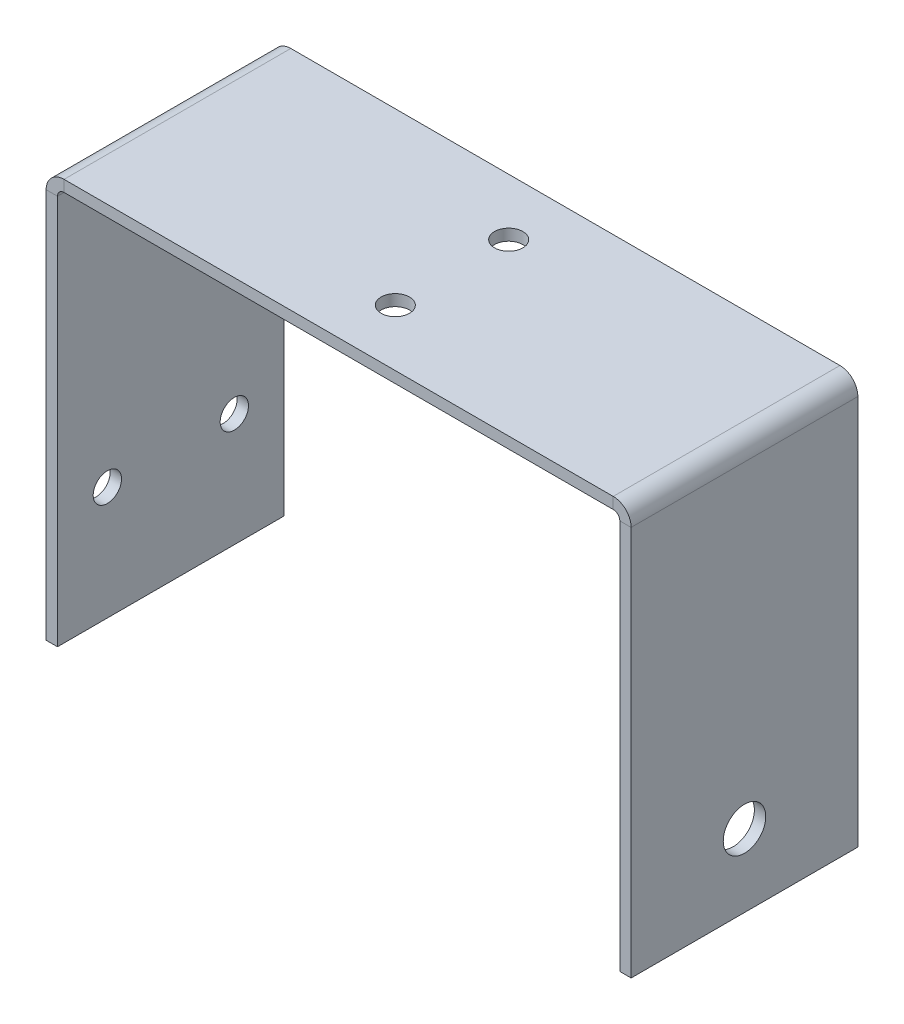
ISO-10303-21;
HEADER;
FILE_DESCRIPTION(('STEP AP214'),'2;1');
FILE_NAME('part.step','',(''),(''),'','','');
FILE_SCHEMA(('AUTOMOTIVE_DESIGN { 1 0 10303 214 1 1 1 1 }'));
ENDSEC;
DATA;
#1=APPLICATION_CONTEXT('core data for automotive mechanical design processes');
#2=APPLICATION_PROTOCOL_DEFINITION('international standard','automotive_design',2000,#1);
#3=PRODUCT_CONTEXT('',#1,'mechanical');
#4=PRODUCT('Part','Part','',(#3));
#5=PRODUCT_RELATED_PRODUCT_CATEGORY('part','',(#4));
#6=PRODUCT_DEFINITION_FORMATION('','',#4);
#7=PRODUCT_DEFINITION_CONTEXT('part definition',#1,'design');
#8=PRODUCT_DEFINITION('design','',#6,#7);
#9=PRODUCT_DEFINITION_SHAPE('','',#8);
#10=(LENGTH_UNIT() NAMED_UNIT(*) SI_UNIT(.MILLI.,.METRE.));
#11=(NAMED_UNIT(*) PLANE_ANGLE_UNIT() SI_UNIT($,.RADIAN.));
#12=(NAMED_UNIT(*) SI_UNIT($,.STERADIAN.) SOLID_ANGLE_UNIT());
#13=UNCERTAINTY_MEASURE_WITH_UNIT(LENGTH_MEASURE(1.E-05),#10,'distance_accuracy_value','');
#14=(GEOMETRIC_REPRESENTATION_CONTEXT(3) GLOBAL_UNCERTAINTY_ASSIGNED_CONTEXT((#13)) GLOBAL_UNIT_ASSIGNED_CONTEXT((#10,
#11,#12)) REPRESENTATION_CONTEXT('',''));
#15=CARTESIAN_POINT('',(0.,0.,0.));
#16=DIRECTION('',(0.,0.,1.));
#17=DIRECTION('',(1.,0.,0.));
#18=AXIS2_PLACEMENT_3D('',#15,#16,#17);
#19=CARTESIAN_POINT('',(0.,-1.27,0.));
#20=DIRECTION('',(0.,-1.,0.));
#21=DIRECTION('',(0.,0.,-1.));
#22=AXIS2_PLACEMENT_3D('',#19,#20,#21);
#23=PLANE('',#22);
#24=CARTESIAN_POINT('',(0.,-1.27,6.35));
#25=DIRECTION('',(0.,1.,0.));
#26=DIRECTION('',(0.,0.,1.));
#27=AXIS2_PLACEMENT_3D('',#24,#25,#26);
#28=CIRCLE('',#27,1.5875);
#29=CARTESIAN_POINT('',(0.,-1.27,7.9375));
#30=VERTEX_POINT('',#29);
#31=EDGE_CURVE('E240',#30,#30,#28,.T.);
#32=ORIENTED_EDGE('',*,*,#31,.T.);
#33=EDGE_LOOP('',(#32));
#34=FACE_BOUND('',#33,.T.);
#35=CARTESIAN_POINT('',(0.,-1.27,-6.35));
#36=DIRECTION('',(0.,1.,0.));
#37=DIRECTION('',(0.,0.,1.));
#38=AXIS2_PLACEMENT_3D('',#35,#36,#37);
#39=CIRCLE('',#38,1.5875);
#40=CARTESIAN_POINT('',(0.,-1.27,-4.7625));
#41=VERTEX_POINT('',#40);
#42=EDGE_CURVE('E246',#41,#41,#39,.T.);
#43=ORIENTED_EDGE('',*,*,#42,.T.);
#44=EDGE_LOOP('',(#43));
#45=FACE_BOUND('',#44,.T.);
#46=DIRECTION('',(-1.,0.,0.));
#47=VECTOR('',#46,1.);
#48=CARTESIAN_POINT('',(-31.496,-1.27,-12.7));
#49=LINE('',#48,#47);
#50=CARTESIAN_POINT('',(30.7594,-1.27,-12.7));
#51=VERTEX_POINT('',#50);
#52=CARTESIAN_POINT('',(-30.7594,-1.27,-12.7));
#53=VERTEX_POINT('',#52);
#54=EDGE_CURVE('E44',#51,#53,#49,.T.);
#55=ORIENTED_EDGE('',*,*,#54,.F.);
#56=DIRECTION('',(0.,0.,1.));
#57=VECTOR('',#56,1.);
#58=CARTESIAN_POINT('',(30.7594,-1.27,12.7));
#59=LINE('',#58,#57);
#60=CARTESIAN_POINT('',(30.7594,-1.27,12.7));
#61=VERTEX_POINT('',#60);
#62=EDGE_CURVE('E177',#61,#51,#59,.F.);
#63=ORIENTED_EDGE('',*,*,#62,.F.);
#64=DIRECTION('',(1.,0.,0.));
#65=VECTOR('',#64,1.);
#66=CARTESIAN_POINT('',(-31.496,-1.27,12.7));
#67=LINE('',#66,#65);
#68=CARTESIAN_POINT('',(-30.7594,-1.27,12.7));
#69=VERTEX_POINT('',#68);
#70=EDGE_CURVE('E11',#69,#61,#67,.T.);
#71=ORIENTED_EDGE('',*,*,#70,.F.);
#72=DIRECTION('',(0.,0.,-1.));
#73=VECTOR('',#72,1.);
#74=CARTESIAN_POINT('',(-30.7594,-1.27,-12.7));
#75=LINE('',#74,#73);
#76=EDGE_CURVE('E232',#53,#69,#75,.F.);
#77=ORIENTED_EDGE('',*,*,#76,.F.);
#78=EDGE_LOOP('',(#55,#63,#71,#77));
#79=FACE_BOUND('',#78,.T.);
#80=ADVANCED_FACE('F35',(#34,#45,#79),#23,.T.);
#81=CARTESIAN_POINT('',(0.,0.,0.));
#82=DIRECTION('',(0.,-1.,0.));
#83=DIRECTION('',(0.,0.,-1.));
#84=AXIS2_PLACEMENT_3D('',#81,#82,#83);
#85=PLANE('',#84);
#86=CARTESIAN_POINT('',(0.,0.,6.35));
#87=DIRECTION('',(0.,1.,0.));
#88=DIRECTION('',(0.,0.,1.));
#89=AXIS2_PLACEMENT_3D('',#86,#87,#88);
#90=CIRCLE('',#89,1.5875);
#91=CARTESIAN_POINT('',(0.,0.,7.9375));
#92=VERTEX_POINT('',#91);
#93=EDGE_CURVE('E238',#92,#92,#90,.T.);
#94=ORIENTED_EDGE('',*,*,#93,.F.);
#95=EDGE_LOOP('',(#94));
#96=FACE_BOUND('',#95,.T.);
#97=CARTESIAN_POINT('',(0.,0.,-6.35));
#98=DIRECTION('',(0.,1.,0.));
#99=DIRECTION('',(0.,0.,1.));
#100=AXIS2_PLACEMENT_3D('',#97,#98,#99);
#101=CIRCLE('',#100,1.5875);
#102=CARTESIAN_POINT('',(0.,0.,-4.7625));
#103=VERTEX_POINT('',#102);
#104=EDGE_CURVE('E243',#103,#103,#101,.T.);
#105=ORIENTED_EDGE('',*,*,#104,.F.);
#106=EDGE_LOOP('',(#105));
#107=FACE_BOUND('',#106,.T.);
#108=DIRECTION('',(0.,0.,1.));
#109=VECTOR('',#108,1.);
#110=CARTESIAN_POINT('',(30.7594,0.,12.7));
#111=LINE('',#110,#109);
#112=CARTESIAN_POINT('',(30.7594,0.,12.7));
#113=VERTEX_POINT('',#112);
#114=CARTESIAN_POINT('',(30.7594,0.,-12.7));
#115=VERTEX_POINT('',#114);
#116=EDGE_CURVE('E165',#113,#115,#111,.F.);
#117=ORIENTED_EDGE('',*,*,#116,.T.);
#118=DIRECTION('',(-1.,0.,0.));
#119=VECTOR('',#118,1.);
#120=CARTESIAN_POINT('',(-31.496,0.,-12.7));
#121=LINE('',#120,#119);
#122=CARTESIAN_POINT('',(-30.7594,0.,-12.7));
#123=VERTEX_POINT('',#122);
#124=EDGE_CURVE('E249',#115,#123,#121,.T.);
#125=ORIENTED_EDGE('',*,*,#124,.T.);
#126=DIRECTION('',(0.,0.,-1.));
#127=VECTOR('',#126,1.);
#128=CARTESIAN_POINT('',(-30.7594,0.,-12.7));
#129=LINE('',#128,#127);
#130=CARTESIAN_POINT('',(-30.7594,0.,12.7));
#131=VERTEX_POINT('',#130);
#132=EDGE_CURVE('E220',#123,#131,#129,.F.);
#133=ORIENTED_EDGE('',*,*,#132,.T.);
#134=DIRECTION('',(1.,0.,0.));
#135=VECTOR('',#134,1.);
#136=CARTESIAN_POINT('',(-31.496,0.,12.7));
#137=LINE('',#136,#135);
#138=EDGE_CURVE('E252',#131,#113,#137,.T.);
#139=ORIENTED_EDGE('',*,*,#138,.T.);
#140=EDGE_LOOP('',(#117,#125,#133,#139));
#141=FACE_BOUND('',#140,.T.);
#142=ADVANCED_FACE('F299',(#96,#107,#141),#85,.F.);
#143=CARTESIAN_POINT('',(-31.496,-1.27,12.7));
#144=DIRECTION('',(0.,0.,1.));
#145=DIRECTION('',(1.,0.,0.));
#146=AXIS2_PLACEMENT_3D('',#143,#144,#145);
#147=PLANE('',#146);
#148=ORIENTED_EDGE('',*,*,#70,.T.);
#149=DIRECTION('',(0.,1.,0.));
#150=VECTOR('',#149,1.);
#151=CARTESIAN_POINT('',(30.7594,-1.27,12.7));
#152=LINE('',#151,#150);
#153=EDGE_CURVE('E171',#61,#113,#152,.T.);
#154=ORIENTED_EDGE('',*,*,#153,.T.);
#155=ORIENTED_EDGE('',*,*,#138,.F.);
#156=DIRECTION('',(0.,1.,0.));
#157=VECTOR('',#156,1.);
#158=CARTESIAN_POINT('',(-30.7594,-1.27,12.7));
#159=LINE('',#158,#157);
#160=EDGE_CURVE('E58',#69,#131,#159,.T.);
#161=ORIENTED_EDGE('',*,*,#160,.F.);
#162=EDGE_LOOP('',(#148,#154,#155,#161));
#163=FACE_BOUND('',#162,.T.);
#164=ADVANCED_FACE('F295',(#163),#147,.T.);
#165=CARTESIAN_POINT('',(-31.496,-1.27,-12.7));
#166=DIRECTION('',(0.,0.,-1.));
#167=DIRECTION('',(-1.,0.,0.));
#168=AXIS2_PLACEMENT_3D('',#165,#166,#167);
#169=PLANE('',#168);
#170=DIRECTION('',(0.,1.,0.));
#171=VECTOR('',#170,1.);
#172=CARTESIAN_POINT('',(30.7594,-1.27,-12.7));
#173=LINE('',#172,#171);
#174=EDGE_CURVE('E182',#51,#115,#173,.T.);
#175=ORIENTED_EDGE('',*,*,#174,.F.);
#176=ORIENTED_EDGE('',*,*,#54,.T.);
#177=DIRECTION('',(0.,1.,0.));
#178=VECTOR('',#177,1.);
#179=CARTESIAN_POINT('',(-30.7594,-1.27,-12.7));
#180=LINE('',#179,#178);
#181=EDGE_CURVE('E226',#53,#123,#180,.T.);
#182=ORIENTED_EDGE('',*,*,#181,.T.);
#183=ORIENTED_EDGE('',*,*,#124,.F.);
#184=EDGE_LOOP('',(#175,#176,#182,#183));
#185=FACE_BOUND('',#184,.T.);
#186=ADVANCED_FACE('F37',(#185),#169,.T.);
#187=CARTESIAN_POINT('',(0.,-1.27,-6.35));
#188=DIRECTION('',(0.,1.,0.));
#189=DIRECTION('',(0.,0.,1.));
#190=AXIS2_PLACEMENT_3D('',#187,#188,#189);
#191=CYLINDRICAL_SURFACE('',#190,1.5875);
#192=ORIENTED_EDGE('',*,*,#42,.F.);
#193=EDGE_LOOP('',(#192));
#194=FACE_BOUND('',#193,.T.);
#195=ORIENTED_EDGE('',*,*,#104,.T.);
#196=EDGE_LOOP('',(#195));
#197=FACE_BOUND('',#196,.T.);
#198=ADVANCED_FACE('F326',(#194,#197),#191,.F.);
#199=CARTESIAN_POINT('',(0.,-1.27,6.35));
#200=DIRECTION('',(0.,1.,0.));
#201=DIRECTION('',(0.,0.,1.));
#202=AXIS2_PLACEMENT_3D('',#199,#200,#201);
#203=CYLINDRICAL_SURFACE('',#202,1.5875);
#204=ORIENTED_EDGE('',*,*,#31,.F.);
#205=EDGE_LOOP('',(#204));
#206=FACE_BOUND('',#205,.T.);
#207=ORIENTED_EDGE('',*,*,#93,.T.);
#208=EDGE_LOOP('',(#207));
#209=FACE_BOUND('',#208,.T.);
#210=ADVANCED_FACE('F335',(#206,#209),#203,.F.);
#211=CARTESIAN_POINT('',(-30.7594,-2.0066,12.7));
#212=DIRECTION('',(0.,0.,1.));
#213=DIRECTION('',(1.,0.,0.));
#214=AXIS2_PLACEMENT_3D('',#211,#212,#213);
#215=PLANE('',#214);
#216=DIRECTION('',(-1.,0.,0.));
#217=VECTOR('',#216,1.);
#218=CARTESIAN_POINT('',(-31.496,-2.0066,12.7));
#219=LINE('',#218,#217);
#220=CARTESIAN_POINT('',(-31.496,-2.0066,12.7));
#221=VERTEX_POINT('',#220);
#222=CARTESIAN_POINT('',(-32.766,-2.0066,12.7));
#223=VERTEX_POINT('',#222);
#224=EDGE_CURVE('E185',#221,#223,#219,.T.);
#225=ORIENTED_EDGE('',*,*,#224,.F.);
#226=CARTESIAN_POINT('',(-30.7594,-2.0066,12.7));
#227=DIRECTION('',(0.,0.,-1.));
#228=DIRECTION('',(-1.,0.,0.));
#229=AXIS2_PLACEMENT_3D('',#226,#227,#228);
#230=CIRCLE('',#229,0.7366);
#231=EDGE_CURVE('E229',#69,#221,#230,.F.);
#232=ORIENTED_EDGE('',*,*,#231,.F.);
#233=ORIENTED_EDGE('',*,*,#160,.T.);
#234=CARTESIAN_POINT('',(-30.7594,-2.0066,12.7));
#235=DIRECTION('',(0.,0.,-1.));
#236=DIRECTION('',(-1.,0.,0.));
#237=AXIS2_PLACEMENT_3D('',#234,#235,#236);
#238=CIRCLE('',#237,2.0066);
#239=EDGE_CURVE('E222',#131,#223,#238,.F.);
#240=ORIENTED_EDGE('',*,*,#239,.T.);
#241=EDGE_LOOP('',(#225,#232,#233,#240));
#242=FACE_BOUND('',#241,.T.);
#243=ADVANCED_FACE('F340',(#242),#215,.T.);
#244=CARTESIAN_POINT('',(-30.7594,-2.0066,-12.7));
#245=DIRECTION('',(0.,0.,1.));
#246=DIRECTION('',(1.,0.,0.));
#247=AXIS2_PLACEMENT_3D('',#244,#245,#246);
#248=PLANE('',#247);
#249=CARTESIAN_POINT('',(-30.7594,-2.0066,-12.7));
#250=DIRECTION('',(0.,0.,-1.));
#251=DIRECTION('',(-1.,0.,0.));
#252=AXIS2_PLACEMENT_3D('',#249,#250,#251);
#253=CIRCLE('',#252,0.7366);
#254=CARTESIAN_POINT('',(-31.496,-2.0066,-12.7));
#255=VERTEX_POINT('',#254);
#256=EDGE_CURVE('E217',#255,#53,#253,.T.);
#257=ORIENTED_EDGE('',*,*,#256,.F.);
#258=DIRECTION('',(-1.,0.,0.));
#259=VECTOR('',#258,1.);
#260=CARTESIAN_POINT('',(-31.496,-2.0066,-12.7));
#261=LINE('',#260,#259);
#262=CARTESIAN_POINT('',(-32.766,-2.0066,-12.7));
#263=VERTEX_POINT('',#262);
#264=EDGE_CURVE('E190',#255,#263,#261,.T.);
#265=ORIENTED_EDGE('',*,*,#264,.T.);
#266=CARTESIAN_POINT('',(-30.7594,-2.0066,-12.7));
#267=DIRECTION('',(0.,0.,-1.));
#268=DIRECTION('',(-1.,0.,0.));
#269=AXIS2_PLACEMENT_3D('',#266,#267,#268);
#270=CIRCLE('',#269,2.0066);
#271=EDGE_CURVE('E223',#263,#123,#270,.T.);
#272=ORIENTED_EDGE('',*,*,#271,.T.);
#273=ORIENTED_EDGE('',*,*,#181,.F.);
#274=EDGE_LOOP('',(#257,#265,#272,#273));
#275=FACE_BOUND('',#274,.T.);
#276=ADVANCED_FACE('F351',(#275),#248,.F.);
#277=CARTESIAN_POINT('',(-30.7594,-2.0066,-12.7));
#278=DIRECTION('',(0.,0.,-1.));
#279=DIRECTION('',(-1.,0.,0.));
#280=AXIS2_PLACEMENT_3D('',#277,#278,#279);
#281=CYLINDRICAL_SURFACE('',#280,2.0066);
#282=ORIENTED_EDGE('',*,*,#132,.F.);
#283=ORIENTED_EDGE('',*,*,#271,.F.);
#284=DIRECTION('',(0.,0.,-1.));
#285=VECTOR('',#284,1.);
#286=CARTESIAN_POINT('',(-32.766,-2.0066,0.));
#287=LINE('',#286,#285);
#288=EDGE_CURVE('E193',#223,#263,#287,.T.);
#289=ORIENTED_EDGE('',*,*,#288,.F.);
#290=ORIENTED_EDGE('',*,*,#239,.F.);
#291=EDGE_LOOP('',(#282,#283,#289,#290));
#292=FACE_BOUND('',#291,.T.);
#293=ADVANCED_FACE('F371',(#292),#281,.T.);
#294=CARTESIAN_POINT('',(-30.7594,-2.0066,-12.7));
#295=DIRECTION('',(0.,0.,-1.));
#296=DIRECTION('',(-1.,0.,0.));
#297=AXIS2_PLACEMENT_3D('',#294,#295,#296);
#298=CYLINDRICAL_SURFACE('',#297,0.7366);
#299=ORIENTED_EDGE('',*,*,#76,.T.);
#300=ORIENTED_EDGE('',*,*,#231,.T.);
#301=DIRECTION('',(0.,0.,-1.));
#302=VECTOR('',#301,1.);
#303=CARTESIAN_POINT('',(-31.496,-2.0066,12.7));
#304=LINE('',#303,#302);
#305=EDGE_CURVE('E188',#221,#255,#304,.T.);
#306=ORIENTED_EDGE('',*,*,#305,.T.);
#307=ORIENTED_EDGE('',*,*,#256,.T.);
#308=EDGE_LOOP('',(#299,#300,#306,#307));
#309=FACE_BOUND('',#308,.T.);
#310=ADVANCED_FACE('F352',(#309),#298,.F.);
#311=CARTESIAN_POINT('',(-32.766,-1.27,-12.7));
#312=DIRECTION('',(0.,0.,-1.));
#313=DIRECTION('',(0.,1.,0.));
#314=AXIS2_PLACEMENT_3D('',#311,#312,#313);
#315=PLANE('',#314);
#316=DIRECTION('',(0.,1.,0.));
#317=VECTOR('',#316,1.);
#318=CARTESIAN_POINT('',(-32.766,-1.27,-12.7));
#319=LINE('',#318,#317);
#320=CARTESIAN_POINT('',(-32.7660000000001,-45.72,-12.7));
#321=VERTEX_POINT('',#320);
#322=EDGE_CURVE('E205',#321,#263,#319,.T.);
#323=ORIENTED_EDGE('',*,*,#322,.T.);
#324=ORIENTED_EDGE('',*,*,#264,.F.);
#325=DIRECTION('',(0.,1.,0.));
#326=VECTOR('',#325,1.);
#327=CARTESIAN_POINT('',(-31.496,-1.27,-12.7));
#328=LINE('',#327,#326);
#329=CARTESIAN_POINT('',(-31.4960000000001,-45.72,-12.7));
#330=VERTEX_POINT('',#329);
#331=EDGE_CURVE('E202',#330,#255,#328,.T.);
#332=ORIENTED_EDGE('',*,*,#331,.F.);
#333=DIRECTION('',(1.,0.,0.));
#334=VECTOR('',#333,1.);
#335=CARTESIAN_POINT('',(-32.7660000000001,-45.72,-12.7));
#336=LINE('',#335,#334);
#337=EDGE_CURVE('E215',#321,#330,#336,.T.);
#338=ORIENTED_EDGE('',*,*,#337,.F.);
#339=EDGE_LOOP('',(#323,#324,#332,#338));
#340=FACE_BOUND('',#339,.T.);
#341=ADVANCED_FACE('F365',(#340),#315,.T.);
#342=CARTESIAN_POINT('',(-32.7660000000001,-45.72,12.7));
#343=DIRECTION('',(0.,0.,1.));
#344=DIRECTION('',(0.,-1.,0.));
#345=AXIS2_PLACEMENT_3D('',#342,#343,#344);
#346=PLANE('',#345);
#347=DIRECTION('',(0.,-1.,0.));
#348=VECTOR('',#347,1.);
#349=CARTESIAN_POINT('',(-31.4960000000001,-45.72,12.7));
#350=LINE('',#349,#348);
#351=CARTESIAN_POINT('',(-31.4960000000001,-45.72,12.7));
#352=VERTEX_POINT('',#351);
#353=EDGE_CURVE('E198',#221,#352,#350,.T.);
#354=ORIENTED_EDGE('',*,*,#353,.F.);
#355=ORIENTED_EDGE('',*,*,#224,.T.);
#356=DIRECTION('',(0.,-1.,0.));
#357=VECTOR('',#356,1.);
#358=CARTESIAN_POINT('',(-32.7660000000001,-45.72,12.7));
#359=LINE('',#358,#357);
#360=CARTESIAN_POINT('',(-32.7660000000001,-45.72,12.7));
#361=VERTEX_POINT('',#360);
#362=EDGE_CURVE('E199',#223,#361,#359,.T.);
#363=ORIENTED_EDGE('',*,*,#362,.T.);
#364=DIRECTION('',(1.,0.,0.));
#365=VECTOR('',#364,1.);
#366=CARTESIAN_POINT('',(-32.7660000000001,-45.72,12.7));
#367=LINE('',#366,#365);
#368=EDGE_CURVE('E208',#361,#352,#367,.T.);
#369=ORIENTED_EDGE('',*,*,#368,.T.);
#370=EDGE_LOOP('',(#354,#355,#363,#369));
#371=FACE_BOUND('',#370,.T.);
#372=ADVANCED_FACE('F359',(#371),#346,.T.);
#373=CARTESIAN_POINT('',(-32.766,1.12601624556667E-13,0.));
#374=DIRECTION('',(-1.,0.,0.));
#375=DIRECTION('',(0.,-1.,0.));
#376=AXIS2_PLACEMENT_3D('',#373,#374,#375);
#377=PLANE('',#376);
#378=CARTESIAN_POINT('',(-32.7660000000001,-33.02,-7.112));
#379=DIRECTION('',(-1.,0.,0.));
#380=DIRECTION('',(0.,1.,0.));
#381=AXIS2_PLACEMENT_3D('',#378,#379,#380);
#382=CIRCLE('',#381,1.5875);
#383=CARTESIAN_POINT('',(-32.7660000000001,-31.4325,-7.112));
#384=VERTEX_POINT('',#383);
#385=EDGE_CURVE('E261',#384,#384,#382,.T.);
#386=ORIENTED_EDGE('',*,*,#385,.F.);
#387=EDGE_LOOP('',(#386));
#388=FACE_BOUND('',#387,.T.);
#389=CARTESIAN_POINT('',(-32.7660000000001,-33.02,7.11199999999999));
#390=DIRECTION('',(-1.,0.,0.));
#391=DIRECTION('',(0.,-1.,0.));
#392=AXIS2_PLACEMENT_3D('',#389,#390,#391);
#393=CIRCLE('',#392,1.5875);
#394=CARTESIAN_POINT('',(-32.7660000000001,-34.6075,7.11199999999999));
#395=VERTEX_POINT('',#394);
#396=EDGE_CURVE('E258',#395,#395,#393,.T.);
#397=ORIENTED_EDGE('',*,*,#396,.F.);
#398=EDGE_LOOP('',(#397));
#399=FACE_BOUND('',#398,.T.);
#400=ORIENTED_EDGE('',*,*,#362,.F.);
#401=ORIENTED_EDGE('',*,*,#288,.T.);
#402=ORIENTED_EDGE('',*,*,#322,.F.);
#403=DIRECTION('',(0.,0.,-1.));
#404=VECTOR('',#403,1.);
#405=CARTESIAN_POINT('',(-32.7660000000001,-45.72,-12.7));
#406=LINE('',#405,#404);
#407=EDGE_CURVE('E201',#361,#321,#406,.T.);
#408=ORIENTED_EDGE('',*,*,#407,.F.);
#409=EDGE_LOOP('',(#400,#401,#402,#408));
#410=FACE_BOUND('',#409,.T.);
#411=ADVANCED_FACE('F368',(#388,#399,#410),#377,.T.);
#412=CARTESIAN_POINT('',(-31.496,1.08167443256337E-13,0.));
#413=DIRECTION('',(-1.,0.,0.));
#414=DIRECTION('',(0.,-1.,0.));
#415=AXIS2_PLACEMENT_3D('',#412,#413,#414);
#416=PLANE('',#415);
#417=CARTESIAN_POINT('',(-31.4960000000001,-33.02,-7.112));
#418=DIRECTION('',(-1.,0.,0.));
#419=DIRECTION('',(0.,-1.,0.));
#420=AXIS2_PLACEMENT_3D('',#417,#418,#419);
#421=CIRCLE('',#420,1.5875);
#422=CARTESIAN_POINT('',(-31.4960000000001,-34.6075,-7.112));
#423=VERTEX_POINT('',#422);
#424=EDGE_CURVE('E259',#423,#423,#421,.T.);
#425=ORIENTED_EDGE('',*,*,#424,.T.);
#426=EDGE_LOOP('',(#425));
#427=FACE_BOUND('',#426,.T.);
#428=CARTESIAN_POINT('',(-31.4960000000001,-33.02,7.11199999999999));
#429=DIRECTION('',(-1.,0.,0.));
#430=DIRECTION('',(0.,-1.,0.));
#431=AXIS2_PLACEMENT_3D('',#428,#429,#430);
#432=CIRCLE('',#431,1.5875);
#433=CARTESIAN_POINT('',(-31.4960000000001,-34.6075,7.11199999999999));
#434=VERTEX_POINT('',#433);
#435=EDGE_CURVE('E256',#434,#434,#432,.T.);
#436=ORIENTED_EDGE('',*,*,#435,.T.);
#437=EDGE_LOOP('',(#436));
#438=FACE_BOUND('',#437,.T.);
#439=ORIENTED_EDGE('',*,*,#305,.F.);
#440=ORIENTED_EDGE('',*,*,#353,.T.);
#441=DIRECTION('',(0.,0.,-1.));
#442=VECTOR('',#441,1.);
#443=CARTESIAN_POINT('',(-31.4960000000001,-45.72,-12.7));
#444=LINE('',#443,#442);
#445=EDGE_CURVE('E210',#352,#330,#444,.T.);
#446=ORIENTED_EDGE('',*,*,#445,.T.);
#447=ORIENTED_EDGE('',*,*,#331,.T.);
#448=EDGE_LOOP('',(#439,#440,#446,#447));
#449=FACE_BOUND('',#448,.T.);
#450=ADVANCED_FACE('F312',(#427,#438,#449),#416,.F.);
#451=CARTESIAN_POINT('',(-32.7660000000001,-45.72,-12.7));
#452=DIRECTION('',(0.,-1.,0.));
#453=DIRECTION('',(1.,0.,0.));
#454=AXIS2_PLACEMENT_3D('',#451,#452,#453);
#455=PLANE('',#454);
#456=ORIENTED_EDGE('',*,*,#445,.F.);
#457=ORIENTED_EDGE('',*,*,#368,.F.);
#458=ORIENTED_EDGE('',*,*,#407,.T.);
#459=ORIENTED_EDGE('',*,*,#337,.T.);
#460=EDGE_LOOP('',(#456,#457,#458,#459));
#461=FACE_BOUND('',#460,.T.);
#462=ADVANCED_FACE('F305',(#461),#455,.T.);
#463=CARTESIAN_POINT('',(30.7594,-2.0066,-12.7));
#464=DIRECTION('',(0.,0.,-1.));
#465=DIRECTION('',(-1.,0.,0.));
#466=AXIS2_PLACEMENT_3D('',#463,#464,#465);
#467=PLANE('',#466);
#468=DIRECTION('',(1.,0.,0.));
#469=VECTOR('',#468,1.);
#470=CARTESIAN_POINT('',(31.496,-2.0066,-12.7));
#471=LINE('',#470,#469);
#472=CARTESIAN_POINT('',(31.496,-2.0066,-12.7));
#473=VERTEX_POINT('',#472);
#474=CARTESIAN_POINT('',(32.766,-2.0066,-12.7));
#475=VERTEX_POINT('',#474);
#476=EDGE_CURVE('E151',#473,#475,#471,.T.);
#477=ORIENTED_EDGE('',*,*,#476,.F.);
#478=CARTESIAN_POINT('',(30.7594,-2.0066,-12.7));
#479=DIRECTION('',(0.,0.,1.));
#480=DIRECTION('',(1.,0.,0.));
#481=AXIS2_PLACEMENT_3D('',#478,#479,#480);
#482=CIRCLE('',#481,0.7366);
#483=EDGE_CURVE('E174',#51,#473,#482,.F.);
#484=ORIENTED_EDGE('',*,*,#483,.F.);
#485=ORIENTED_EDGE('',*,*,#174,.T.);
#486=CARTESIAN_POINT('',(30.7594,-2.0066,-12.7));
#487=DIRECTION('',(0.,0.,1.));
#488=DIRECTION('',(1.,0.,0.));
#489=AXIS2_PLACEMENT_3D('',#486,#487,#488);
#490=CIRCLE('',#489,2.0066);
#491=EDGE_CURVE('E167',#115,#475,#490,.F.);
#492=ORIENTED_EDGE('',*,*,#491,.T.);
#493=EDGE_LOOP('',(#477,#484,#485,#492));
#494=FACE_BOUND('',#493,.T.);
#495=ADVANCED_FACE('F303',(#494),#467,.T.);
#496=CARTESIAN_POINT('',(30.7594,-2.0066,12.7));
#497=DIRECTION('',(0.,0.,-1.));
#498=DIRECTION('',(-1.,0.,0.));
#499=AXIS2_PLACEMENT_3D('',#496,#497,#498);
#500=PLANE('',#499);
#501=CARTESIAN_POINT('',(30.7594,-2.0066,12.7));
#502=DIRECTION('',(0.,0.,1.));
#503=DIRECTION('',(1.,0.,0.));
#504=AXIS2_PLACEMENT_3D('',#501,#502,#503);
#505=CIRCLE('',#504,0.7366);
#506=CARTESIAN_POINT('',(31.496,-2.0066,12.7));
#507=VERTEX_POINT('',#506);
#508=EDGE_CURVE('E163',#507,#61,#505,.T.);
#509=ORIENTED_EDGE('',*,*,#508,.F.);
#510=DIRECTION('',(1.,0.,0.));
#511=VECTOR('',#510,1.);
#512=CARTESIAN_POINT('',(31.496,-2.0066,12.7));
#513=LINE('',#512,#511);
#514=CARTESIAN_POINT('',(32.766,-2.0066,12.7));
#515=VERTEX_POINT('',#514);
#516=EDGE_CURVE('E276',#507,#515,#513,.T.);
#517=ORIENTED_EDGE('',*,*,#516,.T.);
#518=CARTESIAN_POINT('',(30.7594,-2.0066,12.7));
#519=DIRECTION('',(0.,0.,1.));
#520=DIRECTION('',(1.,0.,0.));
#521=AXIS2_PLACEMENT_3D('',#518,#519,#520);
#522=CIRCLE('',#521,2.0066);
#523=EDGE_CURVE('E168',#515,#113,#522,.T.);
#524=ORIENTED_EDGE('',*,*,#523,.T.);
#525=ORIENTED_EDGE('',*,*,#153,.F.);
#526=EDGE_LOOP('',(#509,#517,#524,#525));
#527=FACE_BOUND('',#526,.T.);
#528=ADVANCED_FACE('F293',(#527),#500,.F.);
#529=CARTESIAN_POINT('',(30.7594,-2.0066,12.7));
#530=DIRECTION('',(0.,0.,1.));
#531=DIRECTION('',(1.,0.,0.));
#532=AXIS2_PLACEMENT_3D('',#529,#530,#531);
#533=CYLINDRICAL_SURFACE('',#532,2.0066);
#534=ORIENTED_EDGE('',*,*,#116,.F.);
#535=ORIENTED_EDGE('',*,*,#523,.F.);
#536=DIRECTION('',(0.,0.,1.));
#537=VECTOR('',#536,1.);
#538=CARTESIAN_POINT('',(32.766,-2.0066,0.));
#539=LINE('',#538,#537);
#540=EDGE_CURVE('E156',#475,#515,#539,.T.);
#541=ORIENTED_EDGE('',*,*,#540,.F.);
#542=ORIENTED_EDGE('',*,*,#491,.F.);
#543=EDGE_LOOP('',(#534,#535,#541,#542));
#544=FACE_BOUND('',#543,.T.);
#545=ADVANCED_FACE('F296',(#544),#533,.T.);
#546=CARTESIAN_POINT('',(30.7594,-2.0066,12.7));
#547=DIRECTION('',(0.,0.,1.));
#548=DIRECTION('',(1.,0.,0.));
#549=AXIS2_PLACEMENT_3D('',#546,#547,#548);
#550=CYLINDRICAL_SURFACE('',#549,0.7366);
#551=ORIENTED_EDGE('',*,*,#62,.T.);
#552=ORIENTED_EDGE('',*,*,#483,.T.);
#553=DIRECTION('',(0.,0.,1.));
#554=VECTOR('',#553,1.);
#555=CARTESIAN_POINT('',(31.496,-2.0066,-12.7));
#556=LINE('',#555,#554);
#557=EDGE_CURVE('E274',#473,#507,#556,.T.);
#558=ORIENTED_EDGE('',*,*,#557,.T.);
#559=ORIENTED_EDGE('',*,*,#508,.T.);
#560=EDGE_LOOP('',(#551,#552,#558,#559));
#561=FACE_BOUND('',#560,.T.);
#562=ADVANCED_FACE('F290',(#561),#550,.F.);
#563=CARTESIAN_POINT('',(32.7660000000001,-45.72,12.7));
#564=DIRECTION('',(0.,0.,-1.));
#565=DIRECTION('',(0.,1.,0.));
#566=AXIS2_PLACEMENT_3D('',#563,#564,#565);
#567=PLANE('',#566);
#568=ORIENTED_EDGE('',*,*,#516,.F.);
#569=DIRECTION('',(0.,-1.,0.));
#570=VECTOR('',#569,1.);
#571=CARTESIAN_POINT('',(31.4960000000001,-45.72,12.7));
#572=LINE('',#571,#570);
#573=CARTESIAN_POINT('',(31.4960000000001,-45.72,12.7));
#574=VERTEX_POINT('',#573);
#575=EDGE_CURVE('E152',#507,#574,#572,.T.);
#576=ORIENTED_EDGE('',*,*,#575,.T.);
#577=DIRECTION('',(-1.,0.,0.));
#578=VECTOR('',#577,1.);
#579=CARTESIAN_POINT('',(32.7660000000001,-45.72,12.7));
#580=LINE('',#579,#578);
#581=CARTESIAN_POINT('',(32.7660000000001,-45.72,12.7));
#582=VERTEX_POINT('',#581);
#583=EDGE_CURVE('E147',#582,#574,#580,.T.);
#584=ORIENTED_EDGE('',*,*,#583,.F.);
#585=DIRECTION('',(0.,-1.,0.));
#586=VECTOR('',#585,1.);
#587=CARTESIAN_POINT('',(32.7660000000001,-45.72,12.7));
#588=LINE('',#587,#586);
#589=EDGE_CURVE('E134',#515,#582,#588,.T.);
#590=ORIENTED_EDGE('',*,*,#589,.F.);
#591=EDGE_LOOP('',(#568,#576,#584,#590));
#592=FACE_BOUND('',#591,.T.);
#593=ADVANCED_FACE('F284',(#592),#567,.F.);
#594=CARTESIAN_POINT('',(32.766,-1.27,-12.7));
#595=DIRECTION('',(0.,0.,1.));
#596=DIRECTION('',(0.,-1.,0.));
#597=AXIS2_PLACEMENT_3D('',#594,#595,#596);
#598=PLANE('',#597);
#599=ORIENTED_EDGE('',*,*,#476,.T.);
#600=DIRECTION('',(0.,1.,0.));
#601=VECTOR('',#600,1.);
#602=CARTESIAN_POINT('',(32.766,-1.27,-12.7));
#603=LINE('',#602,#601);
#604=CARTESIAN_POINT('',(32.7660000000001,-45.72,-12.7));
#605=VERTEX_POINT('',#604);
#606=EDGE_CURVE('E132',#605,#475,#603,.T.);
#607=ORIENTED_EDGE('',*,*,#606,.F.);
#608=DIRECTION('',(-1.,0.,0.));
#609=VECTOR('',#608,1.);
#610=CARTESIAN_POINT('',(32.7660000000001,-45.72,-12.7));
#611=LINE('',#610,#609);
#612=CARTESIAN_POINT('',(31.4960000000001,-45.72,-12.7));
#613=VERTEX_POINT('',#612);
#614=EDGE_CURVE('E140',#605,#613,#611,.T.);
#615=ORIENTED_EDGE('',*,*,#614,.T.);
#616=DIRECTION('',(0.,1.,0.));
#617=VECTOR('',#616,1.);
#618=CARTESIAN_POINT('',(31.496,-1.27,-12.7));
#619=LINE('',#618,#617);
#620=EDGE_CURVE('E160',#613,#473,#619,.T.);
#621=ORIENTED_EDGE('',*,*,#620,.T.);
#622=EDGE_LOOP('',(#599,#607,#615,#621));
#623=FACE_BOUND('',#622,.T.);
#624=ADVANCED_FACE('F150',(#623),#598,.F.);
#625=CARTESIAN_POINT('',(32.766,1.12601624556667E-13,0.));
#626=DIRECTION('',(1.,0.,0.));
#627=DIRECTION('',(0.,-1.,0.));
#628=AXIS2_PLACEMENT_3D('',#625,#626,#627);
#629=PLANE('',#628);
#630=CARTESIAN_POINT('',(32.7660000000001,-37.592,0.));
#631=DIRECTION('',(1.,0.,0.));
#632=DIRECTION('',(0.,1.,0.));
#633=AXIS2_PLACEMENT_3D('',#630,#631,#632);
#634=CIRCLE('',#633,2.38125);
#635=CARTESIAN_POINT('',(32.7660000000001,-35.21075,0.));
#636=VERTEX_POINT('',#635);
#637=EDGE_CURVE('E271',#636,#636,#634,.T.);
#638=ORIENTED_EDGE('',*,*,#637,.F.);
#639=EDGE_LOOP('',(#638));
#640=FACE_BOUND('',#639,.T.);
#641=ORIENTED_EDGE('',*,*,#606,.T.);
#642=ORIENTED_EDGE('',*,*,#540,.T.);
#643=ORIENTED_EDGE('',*,*,#589,.T.);
#644=DIRECTION('',(0.,0.,-1.));
#645=VECTOR('',#644,1.);
#646=CARTESIAN_POINT('',(32.7660000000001,-45.72,-12.7));
#647=LINE('',#646,#645);
#648=EDGE_CURVE('E127',#582,#605,#647,.T.);
#649=ORIENTED_EDGE('',*,*,#648,.T.);
#650=EDGE_LOOP('',(#641,#642,#643,#649));
#651=FACE_BOUND('',#650,.T.);
#652=ADVANCED_FACE('F129',(#640,#651),#629,.T.);
#653=CARTESIAN_POINT('',(31.496,1.08167443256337E-13,0.));
#654=DIRECTION('',(1.,0.,0.));
#655=DIRECTION('',(0.,-1.,0.));
#656=AXIS2_PLACEMENT_3D('',#653,#654,#655);
#657=PLANE('',#656);
#658=CARTESIAN_POINT('',(31.4960000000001,-37.592,0.));
#659=DIRECTION('',(1.,0.,0.));
#660=DIRECTION('',(0.,1.,0.));
#661=AXIS2_PLACEMENT_3D('',#658,#659,#660);
#662=CIRCLE('',#661,2.38125);
#663=CARTESIAN_POINT('',(31.4960000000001,-35.21075,0.));
#664=VERTEX_POINT('',#663);
#665=EDGE_CURVE('E39',#664,#664,#662,.T.);
#666=ORIENTED_EDGE('',*,*,#665,.T.);
#667=EDGE_LOOP('',(#666));
#668=FACE_BOUND('',#667,.T.);
#669=ORIENTED_EDGE('',*,*,#557,.F.);
#670=ORIENTED_EDGE('',*,*,#620,.F.);
#671=DIRECTION('',(0.,0.,-1.));
#672=VECTOR('',#671,1.);
#673=CARTESIAN_POINT('',(31.4960000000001,-45.72,-12.7));
#674=LINE('',#673,#672);
#675=EDGE_CURVE('E143',#574,#613,#674,.T.);
#676=ORIENTED_EDGE('',*,*,#675,.F.);
#677=ORIENTED_EDGE('',*,*,#575,.F.);
#678=EDGE_LOOP('',(#669,#670,#676,#677));
#679=FACE_BOUND('',#678,.T.);
#680=ADVANCED_FACE('F288',(#668,#679),#657,.F.);
#681=CARTESIAN_POINT('',(32.7660000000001,-45.72,-12.7));
#682=DIRECTION('',(0.,1.,0.));
#683=DIRECTION('',(-1.,0.,0.));
#684=AXIS2_PLACEMENT_3D('',#681,#682,#683);
#685=PLANE('',#684);
#686=ORIENTED_EDGE('',*,*,#675,.T.);
#687=ORIENTED_EDGE('',*,*,#614,.F.);
#688=ORIENTED_EDGE('',*,*,#648,.F.);
#689=ORIENTED_EDGE('',*,*,#583,.T.);
#690=EDGE_LOOP('',(#686,#687,#688,#689));
#691=FACE_BOUND('',#690,.T.);
#692=ADVANCED_FACE('F141',(#691),#685,.F.);
#693=CARTESIAN_POINT('',(-30.2260000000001,-33.02,7.11199999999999));
#694=DIRECTION('',(-1.,0.,0.));
#695=DIRECTION('',(0.,-1.,0.));
#696=AXIS2_PLACEMENT_3D('',#693,#694,#695);
#697=CYLINDRICAL_SURFACE('',#696,1.5875);
#698=ORIENTED_EDGE('',*,*,#396,.T.);
#699=EDGE_LOOP('',(#698));
#700=FACE_BOUND('',#699,.T.);
#701=ORIENTED_EDGE('',*,*,#435,.F.);
#702=EDGE_LOOP('',(#701));
#703=FACE_BOUND('',#702,.T.);
#704=ADVANCED_FACE('F397',(#700,#703),#697,.F.);
#705=CARTESIAN_POINT('',(-30.2260000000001,-33.02,-7.112));
#706=DIRECTION('',(-1.,0.,0.));
#707=DIRECTION('',(0.,-1.,0.));
#708=AXIS2_PLACEMENT_3D('',#705,#706,#707);
#709=CYLINDRICAL_SURFACE('',#708,1.5875);
#710=ORIENTED_EDGE('',*,*,#385,.T.);
#711=EDGE_LOOP('',(#710));
#712=FACE_BOUND('',#711,.T.);
#713=ORIENTED_EDGE('',*,*,#424,.F.);
#714=EDGE_LOOP('',(#713));
#715=FACE_BOUND('',#714,.T.);
#716=ADVANCED_FACE('F400',(#712,#715),#709,.F.);
#717=CARTESIAN_POINT('',(30.2260000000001,-37.592,0.));
#718=DIRECTION('',(1.,0.,0.));
#719=DIRECTION('',(0.,1.,0.));
#720=AXIS2_PLACEMENT_3D('',#717,#718,#719);
#721=CYLINDRICAL_SURFACE('',#720,2.38125);
#722=ORIENTED_EDGE('',*,*,#637,.T.);
#723=EDGE_LOOP('',(#722));
#724=FACE_BOUND('',#723,.T.);
#725=ORIENTED_EDGE('',*,*,#665,.F.);
#726=EDGE_LOOP('',(#725));
#727=FACE_BOUND('',#726,.T.);
#728=ADVANCED_FACE('F408',(#724,#727),#721,.F.);
#729=CLOSED_SHELL('',(#80,#142,#164,#186,#198,#210,#243,#276,#293,#310,#341,#372,#411,#450,#462,
#495,#528,#545,#562,#593,#624,#652,#680,#692,#704,#716,#728));
#730=MANIFOLD_SOLID_BREP('B2',#729);
#731=ADVANCED_BREP_SHAPE_REPRESENTATION('',(#18,#730),#14);
#732=SHAPE_DEFINITION_REPRESENTATION(#9,#731);
ENDSEC;
END-ISO-10303-21;
